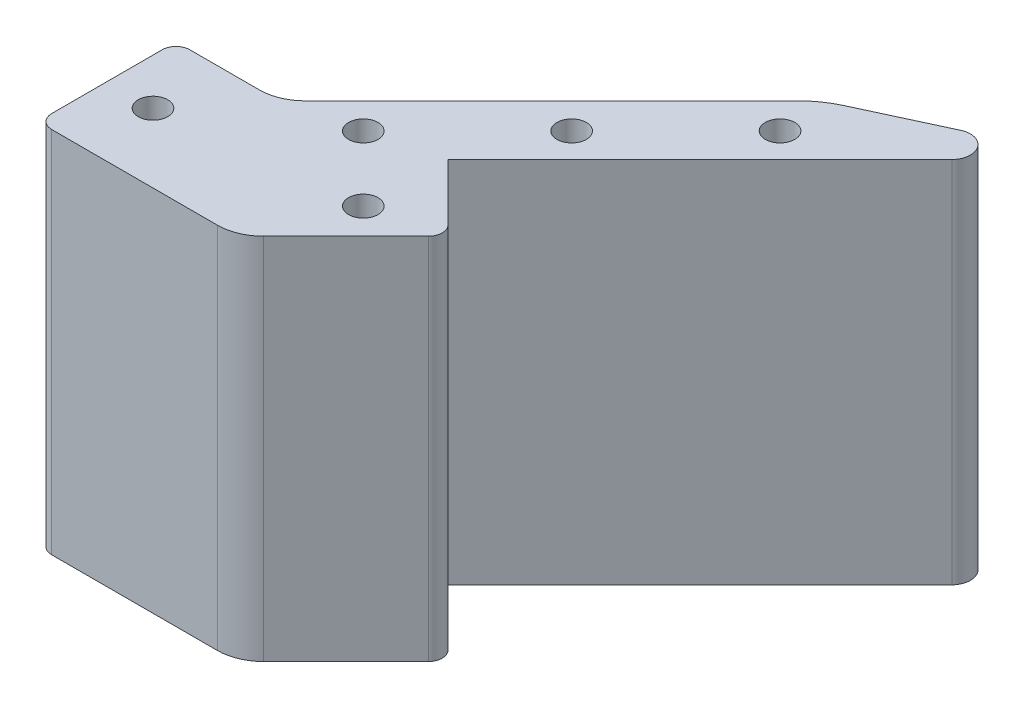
ISO-10303-21;
HEADER;
FILE_DESCRIPTION(('STEP AP214'),'2;1');
FILE_NAME('part.step','',(''),(''),'','','');
FILE_SCHEMA(('AUTOMOTIVE_DESIGN { 1 0 10303 214 1 1 1 1 }'));
ENDSEC;
DATA;
#1=APPLICATION_CONTEXT('core data for automotive mechanical design processes');
#2=APPLICATION_PROTOCOL_DEFINITION('international standard','automotive_design',2000,#1);
#3=PRODUCT_CONTEXT('',#1,'mechanical');
#4=PRODUCT('Part','Part','',(#3));
#5=PRODUCT_RELATED_PRODUCT_CATEGORY('part','',(#4));
#6=PRODUCT_DEFINITION_FORMATION('','',#4);
#7=PRODUCT_DEFINITION_CONTEXT('part definition',#1,'design');
#8=PRODUCT_DEFINITION('design','',#6,#7);
#9=PRODUCT_DEFINITION_SHAPE('','',#8);
#10=(LENGTH_UNIT() NAMED_UNIT(*) SI_UNIT(.MILLI.,.METRE.));
#11=(NAMED_UNIT(*) PLANE_ANGLE_UNIT() SI_UNIT($,.RADIAN.));
#12=(NAMED_UNIT(*) SI_UNIT($,.STERADIAN.) SOLID_ANGLE_UNIT());
#13=UNCERTAINTY_MEASURE_WITH_UNIT(LENGTH_MEASURE(1.E-05),#10,'distance_accuracy_value','');
#14=(GEOMETRIC_REPRESENTATION_CONTEXT(3) GLOBAL_UNCERTAINTY_ASSIGNED_CONTEXT((#13)) GLOBAL_UNIT_ASSIGNED_CONTEXT((#10,
#11,#12)) REPRESENTATION_CONTEXT('',''));
#15=CARTESIAN_POINT('',(0.,0.,0.));
#16=DIRECTION('',(0.,0.,1.));
#17=DIRECTION('',(1.,0.,0.));
#18=AXIS2_PLACEMENT_3D('',#15,#16,#17);
#19=CARTESIAN_POINT('',(-195.567787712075,40.,191.325147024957));
#20=DIRECTION('',(0.,1.,0.));
#21=DIRECTION('',(0.,0.,1.));
#22=AXIS2_PLACEMENT_3D('',#19,#20,#21);
#23=PLANE('',#22);
#24=CARTESIAN_POINT('',(-212.132034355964,40.,199.404112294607));
#25=DIRECTION('',(0.,1.,0.));
#26=DIRECTION('',(0.,0.,1.));
#27=AXIS2_PLACEMENT_3D('',#24,#25,#26);
#28=CIRCLE('',#27,1.59999999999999);
#29=CARTESIAN_POINT('',(-212.132034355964,40.,201.004112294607));
#30=VERTEX_POINT('',#29);
#31=EDGE_CURVE('E345',#30,#30,#28,.T.);
#32=ORIENTED_EDGE('',*,*,#31,.F.);
#33=EDGE_LOOP('',(#32));
#34=FACE_BOUND('',#33,.T.);
#35=CARTESIAN_POINT('',(-200.818325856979,40.,188.090403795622));
#36=DIRECTION('',(0.,1.,0.));
#37=DIRECTION('',(0.,0.,1.));
#38=AXIS2_PLACEMENT_3D('',#35,#36,#37);
#39=CIRCLE('',#38,1.59999999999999);
#40=CARTESIAN_POINT('',(-200.818325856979,40.,189.690403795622));
#41=VERTEX_POINT('',#40);
#42=EDGE_CURVE('E357',#41,#41,#39,.T.);
#43=ORIENTED_EDGE('',*,*,#42,.F.);
#44=EDGE_LOOP('',(#43));
#45=FACE_BOUND('',#44,.T.);
#46=DIRECTION('',(1.,0.,0.));
#47=VECTOR('',#46,1.);
#48=CARTESIAN_POINT('',(-242.,40.,227.5));
#49=LINE('',#48,#47);
#50=CARTESIAN_POINT('',(-240.5,40.,227.5));
#51=VERTEX_POINT('',#50);
#52=CARTESIAN_POINT('',(-222.499999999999,40.,227.5));
#53=VERTEX_POINT('',#52);
#54=EDGE_CURVE('E240',#51,#53,#49,.T.);
#55=ORIENTED_EDGE('',*,*,#54,.T.);
#56=CARTESIAN_POINT('',(-222.499999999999,40.,222.5));
#57=DIRECTION('',(0.,1.,0.));
#58=DIRECTION('',(0.,0.,1.));
#59=AXIS2_PLACEMENT_3D('',#56,#57,#58);
#60=CIRCLE('',#59,5.);
#61=CARTESIAN_POINT('',(-218.964466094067,40.,226.035533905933));
#62=VERTEX_POINT('',#61);
#63=EDGE_CURVE('E222',#53,#62,#60,.T.);
#64=ORIENTED_EDGE('',*,*,#63,.T.);
#65=DIRECTION('',(0.707106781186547,0.,-0.707106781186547));
#66=VECTOR('',#65,1.);
#67=CARTESIAN_POINT('',(-220.428932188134,40.,227.5));
#68=LINE('',#67,#66);
#69=CARTESIAN_POINT('',(-210.010714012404,40.,217.08178182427));
#70=VERTEX_POINT('',#69);
#71=EDGE_CURVE('E244',#62,#70,#68,.T.);
#72=ORIENTED_EDGE('',*,*,#71,.T.);
#73=CARTESIAN_POINT('',(-211.071374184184,40.,216.02112165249));
#74=DIRECTION('',(0.,1.,0.));
#75=DIRECTION('',(0.,0.,1.));
#76=AXIS2_PLACEMENT_3D('',#73,#74,#75);
#77=CIRCLE('',#76,1.5);
#78=CARTESIAN_POINT('',(-210.010714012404,40.,214.960461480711));
#79=VERTEX_POINT('',#78);
#80=EDGE_CURVE('E200',#70,#79,#77,.T.);
#81=ORIENTED_EDGE('',*,*,#80,.T.);
#82=DIRECTION('',(-0.707106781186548,0.,-0.707106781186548));
#83=VECTOR('',#82,1.);
#84=CARTESIAN_POINT('',(-208.950053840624,40.,216.02112165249));
#85=LINE('',#84,#83);
#86=CARTESIAN_POINT('',(-216.162543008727,40.,208.808632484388));
#87=VERTEX_POINT('',#86);
#88=EDGE_CURVE('E246',#79,#87,#85,.T.);
#89=ORIENTED_EDGE('',*,*,#88,.T.);
#90=DIRECTION('',(0.707106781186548,0.,-0.707106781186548));
#91=VECTOR('',#90,1.);
#92=CARTESIAN_POINT('',(-216.162543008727,40.,208.808632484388));
#93=LINE('',#92,#91);
#94=CARTESIAN_POINT('',(-188.79688181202,40.,181.44297128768));
#95=VERTEX_POINT('',#94);
#96=EDGE_CURVE('E248',#87,#95,#93,.T.);
#97=ORIENTED_EDGE('',*,*,#96,.T.);
#98=CARTESIAN_POINT('',(-190.211095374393,40.,180.028757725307));
#99=DIRECTION('',(0.,1.,0.));
#100=DIRECTION('',(0.,0.,1.));
#101=AXIS2_PLACEMENT_3D('',#98,#99,#100);
#102=CIRCLE('',#101,2.);
#103=CARTESIAN_POINT('',(-191.051460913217,40.,178.213878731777));
#104=VERTEX_POINT('',#103);
#105=EDGE_CURVE('E250',#95,#104,#102,.T.);
#106=ORIENTED_EDGE('',*,*,#105,.T.);
#107=DIRECTION('',(-0.907439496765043,0.,0.420182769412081));
#108=VECTOR('',#107,1.);
#109=CARTESIAN_POINT('',(-191.051460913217,40.,178.213878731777));
#110=LINE('',#109,#108);
#111=CARTESIAN_POINT('',(-199.769615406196,40.,182.250752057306));
#112=VERTEX_POINT('',#111);
#113=EDGE_CURVE('E166',#104,#112,#110,.T.);
#114=ORIENTED_EDGE('',*,*,#113,.T.);
#115=CARTESIAN_POINT('',(-195.567787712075,40.,191.325147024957));
#116=DIRECTION('',(0.,1.,0.));
#117=DIRECTION('',(0.,0.,1.));
#118=AXIS2_PLACEMENT_3D('',#115,#116,#117);
#119=CIRCLE('',#118,9.99999999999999);
#120=CARTESIAN_POINT('',(-202.638855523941,40.,184.254079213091));
#121=VERTEX_POINT('',#120);
#122=EDGE_CURVE('E161',#112,#121,#119,.T.);
#123=ORIENTED_EDGE('',*,*,#122,.T.);
#124=DIRECTION('',(-0.707106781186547,0.,0.707106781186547));
#125=VECTOR('',#124,1.);
#126=CARTESIAN_POINT('',(-202.638855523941,40.,184.254079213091));
#127=LINE('',#126,#125);
#128=CARTESIAN_POINT('',(-229.420310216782,40.,211.035533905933));
#129=VERTEX_POINT('',#128);
#130=EDGE_CURVE('E149',#121,#129,#127,.T.);
#131=ORIENTED_EDGE('',*,*,#130,.T.);
#132=CARTESIAN_POINT('',(-232.955844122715,40.,207.5));
#133=DIRECTION('',(0.,1.,0.));
#134=DIRECTION('',(0.,0.,1.));
#135=AXIS2_PLACEMENT_3D('',#132,#133,#134);
#136=CIRCLE('',#135,5.);
#137=CARTESIAN_POINT('',(-232.955844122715,40.,212.5));
#138=VERTEX_POINT('',#137);
#139=EDGE_CURVE('E11',#129,#138,#136,.F.);
#140=ORIENTED_EDGE('',*,*,#139,.T.);
#141=DIRECTION('',(-1.,0.,0.));
#142=VECTOR('',#141,1.);
#143=CARTESIAN_POINT('',(-230.88477631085,40.,212.5));
#144=LINE('',#143,#142);
#145=CARTESIAN_POINT('',(-240.5,40.,212.5));
#146=VERTEX_POINT('',#145);
#147=EDGE_CURVE('E160',#138,#146,#144,.T.);
#148=ORIENTED_EDGE('',*,*,#147,.T.);
#149=CARTESIAN_POINT('',(-240.5,40.,214.));
#150=DIRECTION('',(0.,1.,0.));
#151=DIRECTION('',(0.,0.,1.));
#152=AXIS2_PLACEMENT_3D('',#149,#150,#151);
#153=CIRCLE('',#152,1.5);
#154=CARTESIAN_POINT('',(-242.,40.,214.));
#155=VERTEX_POINT('',#154);
#156=EDGE_CURVE('E198',#146,#155,#153,.T.);
#157=ORIENTED_EDGE('',*,*,#156,.T.);
#158=DIRECTION('',(0.,0.,1.));
#159=VECTOR('',#158,1.);
#160=CARTESIAN_POINT('',(-242.,40.,212.5));
#161=LINE('',#160,#159);
#162=CARTESIAN_POINT('',(-242.,40.,226.));
#163=VERTEX_POINT('',#162);
#164=EDGE_CURVE('E237',#155,#163,#161,.T.);
#165=ORIENTED_EDGE('',*,*,#164,.T.);
#166=CARTESIAN_POINT('',(-240.5,40.,226.));
#167=DIRECTION('',(0.,1.,0.));
#168=DIRECTION('',(0.,0.,1.));
#169=AXIS2_PLACEMENT_3D('',#166,#167,#168);
#170=CIRCLE('',#169,1.5);
#171=EDGE_CURVE('E196',#163,#51,#170,.T.);
#172=ORIENTED_EDGE('',*,*,#171,.T.);
#173=EDGE_LOOP('',(#55,#64,#72,#81,#89,#97,#106,#114,#123,#131,#140,#148,#157,#165,#172));
#174=FACE_BOUND('',#173,.T.);
#175=CARTESIAN_POINT('',(-237.,40.,220.));
#176=DIRECTION('',(0.,1.,0.));
#177=DIRECTION('',(0.,0.,1.));
#178=AXIS2_PLACEMENT_3D('',#175,#176,#177);
#179=CIRCLE('',#178,1.59999999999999);
#180=CARTESIAN_POINT('',(-237.,40.,221.6));
#181=VERTEX_POINT('',#180);
#182=EDGE_CURVE('E254',#181,#181,#179,.T.);
#183=ORIENTED_EDGE('',*,*,#182,.F.);
#184=EDGE_LOOP('',(#183));
#185=FACE_BOUND('',#184,.T.);
#186=CARTESIAN_POINT('',(-216.374675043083,40.,217.788888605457));
#187=DIRECTION('',(0.,1.,0.));
#188=DIRECTION('',(0.,0.,1.));
#189=AXIS2_PLACEMENT_3D('',#186,#187,#188);
#190=CIRCLE('',#189,1.59999999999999);
#191=CARTESIAN_POINT('',(-216.374675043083,40.,219.388888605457));
#192=VERTEX_POINT('',#191);
#193=EDGE_CURVE('E351',#192,#192,#190,.T.);
#194=ORIENTED_EDGE('',*,*,#193,.F.);
#195=EDGE_LOOP('',(#194));
#196=FACE_BOUND('',#195,.T.);
#197=CARTESIAN_POINT('',(-223.445742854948,40.,210.717820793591));
#198=DIRECTION('',(0.,1.,0.));
#199=DIRECTION('',(0.,0.,1.));
#200=AXIS2_PLACEMENT_3D('',#197,#198,#199);
#201=CIRCLE('',#200,1.59999999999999);
#202=CARTESIAN_POINT('',(-223.445742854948,40.,212.317820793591));
#203=VERTEX_POINT('',#202);
#204=EDGE_CURVE('E336',#203,#203,#201,.T.);
#205=ORIENTED_EDGE('',*,*,#204,.F.);
#206=EDGE_LOOP('',(#205));
#207=FACE_BOUND('',#206,.T.);
#208=ADVANCED_FACE('F41',(#34,#45,#174,#185,#196,#207),#23,.T.);
#209=CARTESIAN_POINT('',(-195.567787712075,0.,191.325147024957));
#210=DIRECTION('',(0.,1.,0.));
#211=DIRECTION('',(0.,0.,1.));
#212=AXIS2_PLACEMENT_3D('',#209,#210,#211);
#213=PLANE('',#212);
#214=DIRECTION('',(0.707106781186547,0.,-0.707106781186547));
#215=VECTOR('',#214,1.);
#216=CARTESIAN_POINT('',(-220.428932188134,0.,227.5));
#217=LINE('',#216,#215);
#218=CARTESIAN_POINT('',(-218.964466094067,0.,226.035533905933));
#219=VERTEX_POINT('',#218);
#220=CARTESIAN_POINT('',(-210.010714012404,0.,217.08178182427));
#221=VERTEX_POINT('',#220);
#222=EDGE_CURVE('E262',#219,#221,#217,.T.);
#223=ORIENTED_EDGE('',*,*,#222,.F.);
#224=CARTESIAN_POINT('',(-222.499999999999,0.,222.5));
#225=DIRECTION('',(0.,1.,0.));
#226=DIRECTION('',(0.,0.,1.));
#227=AXIS2_PLACEMENT_3D('',#224,#225,#226);
#228=CIRCLE('',#227,5.);
#229=CARTESIAN_POINT('',(-222.499999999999,0.,227.5));
#230=VERTEX_POINT('',#229);
#231=EDGE_CURVE('E64',#219,#230,#228,.F.);
#232=ORIENTED_EDGE('',*,*,#231,.T.);
#233=DIRECTION('',(1.,0.,0.));
#234=VECTOR('',#233,1.);
#235=CARTESIAN_POINT('',(-242.,0.,227.5));
#236=LINE('',#235,#234);
#237=CARTESIAN_POINT('',(-240.5,0.,227.5));
#238=VERTEX_POINT('',#237);
#239=EDGE_CURVE('E260',#238,#230,#236,.T.);
#240=ORIENTED_EDGE('',*,*,#239,.F.);
#241=CARTESIAN_POINT('',(-240.5,0.,226.));
#242=DIRECTION('',(0.,1.,0.));
#243=DIRECTION('',(0.,0.,1.));
#244=AXIS2_PLACEMENT_3D('',#241,#242,#243);
#245=CIRCLE('',#244,1.5);
#246=CARTESIAN_POINT('',(-242.,0.,226.));
#247=VERTEX_POINT('',#246);
#248=EDGE_CURVE('E179',#238,#247,#245,.F.);
#249=ORIENTED_EDGE('',*,*,#248,.T.);
#250=DIRECTION('',(0.,0.,1.));
#251=VECTOR('',#250,1.);
#252=CARTESIAN_POINT('',(-242.,0.,212.5));
#253=LINE('',#252,#251);
#254=CARTESIAN_POINT('',(-242.,0.,214.));
#255=VERTEX_POINT('',#254);
#256=EDGE_CURVE('E257',#255,#247,#253,.T.);
#257=ORIENTED_EDGE('',*,*,#256,.F.);
#258=CARTESIAN_POINT('',(-240.5,0.,214.));
#259=DIRECTION('',(0.,1.,0.));
#260=DIRECTION('',(0.,0.,1.));
#261=AXIS2_PLACEMENT_3D('',#258,#259,#260);
#262=CIRCLE('',#261,1.5);
#263=CARTESIAN_POINT('',(-240.5,0.,212.5));
#264=VERTEX_POINT('',#263);
#265=EDGE_CURVE('E187',#255,#264,#262,.F.);
#266=ORIENTED_EDGE('',*,*,#265,.T.);
#267=DIRECTION('',(-1.,0.,0.));
#268=VECTOR('',#267,1.);
#269=CARTESIAN_POINT('',(-230.88477631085,0.,212.5));
#270=LINE('',#269,#268);
#271=CARTESIAN_POINT('',(-232.955844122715,0.,212.5));
#272=VERTEX_POINT('',#271);
#273=EDGE_CURVE('E227',#272,#264,#270,.T.);
#274=ORIENTED_EDGE('',*,*,#273,.F.);
#275=CARTESIAN_POINT('',(-232.955844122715,0.,207.5));
#276=DIRECTION('',(0.,1.,0.));
#277=DIRECTION('',(0.,0.,1.));
#278=AXIS2_PLACEMENT_3D('',#275,#276,#277);
#279=CIRCLE('',#278,5.);
#280=CARTESIAN_POINT('',(-229.420310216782,0.,211.035533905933));
#281=VERTEX_POINT('',#280);
#282=EDGE_CURVE('E49',#272,#281,#279,.T.);
#283=ORIENTED_EDGE('',*,*,#282,.T.);
#284=DIRECTION('',(-0.707106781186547,0.,0.707106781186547));
#285=VECTOR('',#284,1.);
#286=CARTESIAN_POINT('',(-202.638855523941,0.,184.254079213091));
#287=LINE('',#286,#285);
#288=CARTESIAN_POINT('',(-202.638855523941,0.,184.254079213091));
#289=VERTEX_POINT('',#288);
#290=EDGE_CURVE('E226',#289,#281,#287,.T.);
#291=ORIENTED_EDGE('',*,*,#290,.F.);
#292=CARTESIAN_POINT('',(-195.567787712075,0.,191.325147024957));
#293=DIRECTION('',(0.,1.,0.));
#294=DIRECTION('',(0.,0.,1.));
#295=AXIS2_PLACEMENT_3D('',#292,#293,#294);
#296=CIRCLE('',#295,9.99999999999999);
#297=CARTESIAN_POINT('',(-199.769615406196,0.,182.250752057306));
#298=VERTEX_POINT('',#297);
#299=EDGE_CURVE('E174',#298,#289,#296,.T.);
#300=ORIENTED_EDGE('',*,*,#299,.F.);
#301=DIRECTION('',(-0.907439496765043,0.,0.420182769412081));
#302=VECTOR('',#301,1.);
#303=CARTESIAN_POINT('',(-191.051460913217,0.,178.213878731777));
#304=LINE('',#303,#302);
#305=CARTESIAN_POINT('',(-191.051460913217,0.,178.213878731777));
#306=VERTEX_POINT('',#305);
#307=EDGE_CURVE('E170',#306,#298,#304,.T.);
#308=ORIENTED_EDGE('',*,*,#307,.F.);
#309=CARTESIAN_POINT('',(-190.211095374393,0.,180.028757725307));
#310=DIRECTION('',(0.,1.,0.));
#311=DIRECTION('',(0.,0.,1.));
#312=AXIS2_PLACEMENT_3D('',#309,#310,#311);
#313=CIRCLE('',#312,2.);
#314=CARTESIAN_POINT('',(-188.79688181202,0.,181.44297128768));
#315=VERTEX_POINT('',#314);
#316=EDGE_CURVE('E268',#315,#306,#313,.T.);
#317=ORIENTED_EDGE('',*,*,#316,.F.);
#318=DIRECTION('',(0.707106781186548,0.,-0.707106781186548));
#319=VECTOR('',#318,1.);
#320=CARTESIAN_POINT('',(-216.162543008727,0.,208.808632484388));
#321=LINE('',#320,#319);
#322=CARTESIAN_POINT('',(-216.162543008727,0.,208.808632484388));
#323=VERTEX_POINT('',#322);
#324=EDGE_CURVE('E266',#323,#315,#321,.T.);
#325=ORIENTED_EDGE('',*,*,#324,.F.);
#326=DIRECTION('',(-0.707106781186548,0.,-0.707106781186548));
#327=VECTOR('',#326,1.);
#328=CARTESIAN_POINT('',(-208.950053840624,0.,216.02112165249));
#329=LINE('',#328,#327);
#330=CARTESIAN_POINT('',(-210.010714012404,0.,214.960461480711));
#331=VERTEX_POINT('',#330);
#332=EDGE_CURVE('E264',#331,#323,#329,.T.);
#333=ORIENTED_EDGE('',*,*,#332,.F.);
#334=CARTESIAN_POINT('',(-211.071374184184,0.,216.02112165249));
#335=DIRECTION('',(0.,1.,0.));
#336=DIRECTION('',(0.,0.,1.));
#337=AXIS2_PLACEMENT_3D('',#334,#335,#336);
#338=CIRCLE('',#337,1.5);
#339=EDGE_CURVE('E190',#331,#221,#338,.F.);
#340=ORIENTED_EDGE('',*,*,#339,.T.);
#341=EDGE_LOOP('',(#223,#232,#240,#249,#257,#266,#274,#283,#291,#300,#308,#317,#325,#333,#340));
#342=FACE_BOUND('',#341,.T.);
#343=CARTESIAN_POINT('',(-237.,0.,220.));
#344=DIRECTION('',(0.,1.,0.));
#345=DIRECTION('',(0.,0.,1.));
#346=AXIS2_PLACEMENT_3D('',#343,#344,#345);
#347=CIRCLE('',#346,1.59999999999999);
#348=CARTESIAN_POINT('',(-237.,0.,221.6));
#349=VERTEX_POINT('',#348);
#350=EDGE_CURVE('E360',#349,#349,#347,.T.);
#351=ORIENTED_EDGE('',*,*,#350,.T.);
#352=EDGE_LOOP('',(#351));
#353=FACE_BOUND('',#352,.T.);
#354=CARTESIAN_POINT('',(-200.818325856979,0.,188.090403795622));
#355=DIRECTION('',(0.,1.,0.));
#356=DIRECTION('',(0.,0.,1.));
#357=AXIS2_PLACEMENT_3D('',#354,#355,#356);
#358=CIRCLE('',#357,1.59999999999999);
#359=CARTESIAN_POINT('',(-200.818325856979,0.,189.690403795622));
#360=VERTEX_POINT('',#359);
#361=EDGE_CURVE('E354',#360,#360,#358,.T.);
#362=ORIENTED_EDGE('',*,*,#361,.T.);
#363=EDGE_LOOP('',(#362));
#364=FACE_BOUND('',#363,.T.);
#365=CARTESIAN_POINT('',(-216.374675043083,0.,217.788888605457));
#366=DIRECTION('',(0.,1.,0.));
#367=DIRECTION('',(0.,0.,1.));
#368=AXIS2_PLACEMENT_3D('',#365,#366,#367);
#369=CIRCLE('',#368,1.59999999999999);
#370=CARTESIAN_POINT('',(-216.374675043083,0.,219.388888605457));
#371=VERTEX_POINT('',#370);
#372=EDGE_CURVE('E348',#371,#371,#369,.T.);
#373=ORIENTED_EDGE('',*,*,#372,.T.);
#374=EDGE_LOOP('',(#373));
#375=FACE_BOUND('',#374,.T.);
#376=CARTESIAN_POINT('',(-212.132034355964,0.,199.404112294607));
#377=DIRECTION('',(0.,1.,0.));
#378=DIRECTION('',(0.,0.,1.));
#379=AXIS2_PLACEMENT_3D('',#376,#377,#378);
#380=CIRCLE('',#379,1.59999999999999);
#381=CARTESIAN_POINT('',(-212.132034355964,0.,201.004112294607));
#382=VERTEX_POINT('',#381);
#383=EDGE_CURVE('E342',#382,#382,#380,.T.);
#384=ORIENTED_EDGE('',*,*,#383,.T.);
#385=EDGE_LOOP('',(#384));
#386=FACE_BOUND('',#385,.T.);
#387=CARTESIAN_POINT('',(-223.445742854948,0.,210.717820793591));
#388=DIRECTION('',(0.,1.,0.));
#389=DIRECTION('',(0.,0.,1.));
#390=AXIS2_PLACEMENT_3D('',#387,#388,#389);
#391=CIRCLE('',#390,1.59999999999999);
#392=CARTESIAN_POINT('',(-223.445742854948,0.,212.317820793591));
#393=VERTEX_POINT('',#392);
#394=EDGE_CURVE('E339',#393,#393,#391,.T.);
#395=ORIENTED_EDGE('',*,*,#394,.T.);
#396=EDGE_LOOP('',(#395));
#397=FACE_BOUND('',#396,.T.);
#398=ADVANCED_FACE('F224',(#342,#353,#364,#375,#386,#397),#213,.F.);
#399=CARTESIAN_POINT('',(-195.567787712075,40.,191.325147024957));
#400=DIRECTION('',(0.,-1.,0.));
#401=DIRECTION('',(0.,0.,-1.));
#402=AXIS2_PLACEMENT_3D('',#399,#400,#401);
#403=CYLINDRICAL_SURFACE('',#402,9.99999999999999);
#404=ORIENTED_EDGE('',*,*,#299,.T.);
#405=DIRECTION('',(0.,-1.,0.));
#406=VECTOR('',#405,1.);
#407=CARTESIAN_POINT('',(-202.638855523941,40.,184.254079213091));
#408=LINE('',#407,#406);
#409=EDGE_CURVE('E154',#121,#289,#408,.T.);
#410=ORIENTED_EDGE('',*,*,#409,.F.);
#411=ORIENTED_EDGE('',*,*,#122,.F.);
#412=DIRECTION('',(0.,-1.,0.));
#413=VECTOR('',#412,1.);
#414=CARTESIAN_POINT('',(-199.769615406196,40.,182.250752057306));
#415=LINE('',#414,#413);
#416=EDGE_CURVE('E253',#112,#298,#415,.T.);
#417=ORIENTED_EDGE('',*,*,#416,.T.);
#418=EDGE_LOOP('',(#404,#410,#411,#417));
#419=FACE_BOUND('',#418,.T.);
#420=ADVANCED_FACE('F172',(#419),#403,.T.);
#421=CARTESIAN_POINT('',(-202.638855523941,40.,184.254079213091));
#422=DIRECTION('',(0.707106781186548,0.,0.707106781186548));
#423=DIRECTION('',(0.707106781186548,0.,-0.707106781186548));
#424=AXIS2_PLACEMENT_3D('',#421,#422,#423);
#425=PLANE('',#424);
#426=ORIENTED_EDGE('',*,*,#290,.T.);
#427=DIRECTION('',(0.,-1.,0.));
#428=VECTOR('',#427,1.);
#429=CARTESIAN_POINT('',(-229.420310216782,40.,211.035533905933));
#430=LINE('',#429,#428);
#431=EDGE_CURVE('E157',#281,#129,#430,.F.);
#432=ORIENTED_EDGE('',*,*,#431,.T.);
#433=ORIENTED_EDGE('',*,*,#130,.F.);
#434=ORIENTED_EDGE('',*,*,#409,.T.);
#435=EDGE_LOOP('',(#426,#432,#433,#434));
#436=FACE_BOUND('',#435,.T.);
#437=ADVANCED_FACE('F152',(#436),#425,.F.);
#438=CARTESIAN_POINT('',(-230.88477631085,40.,212.5));
#439=DIRECTION('',(0.,0.,1.));
#440=DIRECTION('',(1.,0.,0.));
#441=AXIS2_PLACEMENT_3D('',#438,#439,#440);
#442=PLANE('',#441);
#443=ORIENTED_EDGE('',*,*,#147,.F.);
#444=DIRECTION('',(0.,-1.,0.));
#445=VECTOR('',#444,1.);
#446=CARTESIAN_POINT('',(-232.955844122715,0.,212.5));
#447=LINE('',#446,#445);
#448=EDGE_CURVE('E213',#138,#272,#447,.T.);
#449=ORIENTED_EDGE('',*,*,#448,.T.);
#450=ORIENTED_EDGE('',*,*,#273,.T.);
#451=DIRECTION('',(0.,-1.,0.));
#452=VECTOR('',#451,1.);
#453=CARTESIAN_POINT('',(-240.5,40.,212.5));
#454=LINE('',#453,#452);
#455=EDGE_CURVE('E207',#264,#146,#454,.F.);
#456=ORIENTED_EDGE('',*,*,#455,.T.);
#457=EDGE_LOOP('',(#443,#449,#450,#456));
#458=FACE_BOUND('',#457,.T.);
#459=ADVANCED_FACE('F234',(#458),#442,.F.);
#460=CARTESIAN_POINT('',(-242.,40.,212.5));
#461=DIRECTION('',(1.,0.,0.));
#462=DIRECTION('',(0.,0.,-1.));
#463=AXIS2_PLACEMENT_3D('',#460,#461,#462);
#464=PLANE('',#463);
#465=ORIENTED_EDGE('',*,*,#164,.F.);
#466=DIRECTION('',(0.,-1.,0.));
#467=VECTOR('',#466,1.);
#468=CARTESIAN_POINT('',(-242.,40.,214.));
#469=LINE('',#468,#467);
#470=EDGE_CURVE('E204',#155,#255,#469,.T.);
#471=ORIENTED_EDGE('',*,*,#470,.T.);
#472=ORIENTED_EDGE('',*,*,#256,.T.);
#473=DIRECTION('',(0.,-1.,0.));
#474=VECTOR('',#473,1.);
#475=CARTESIAN_POINT('',(-242.,40.,226.));
#476=LINE('',#475,#474);
#477=EDGE_CURVE('E202',#247,#163,#476,.F.);
#478=ORIENTED_EDGE('',*,*,#477,.T.);
#479=EDGE_LOOP('',(#465,#471,#472,#478));
#480=FACE_BOUND('',#479,.T.);
#481=ADVANCED_FACE('F424',(#480),#464,.F.);
#482=CARTESIAN_POINT('',(-242.,40.,227.5));
#483=DIRECTION('',(0.,0.,-1.));
#484=DIRECTION('',(-1.,0.,0.));
#485=AXIS2_PLACEMENT_3D('',#482,#483,#484);
#486=PLANE('',#485);
#487=ORIENTED_EDGE('',*,*,#239,.T.);
#488=DIRECTION('',(0.,-1.,0.));
#489=VECTOR('',#488,1.);
#490=CARTESIAN_POINT('',(-222.499999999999,40.,227.5));
#491=LINE('',#490,#489);
#492=EDGE_CURVE('E56',#230,#53,#491,.F.);
#493=ORIENTED_EDGE('',*,*,#492,.T.);
#494=ORIENTED_EDGE('',*,*,#54,.F.);
#495=DIRECTION('',(0.,-1.,0.));
#496=VECTOR('',#495,1.);
#497=CARTESIAN_POINT('',(-240.5,40.,227.5));
#498=LINE('',#497,#496);
#499=EDGE_CURVE('E210',#51,#238,#498,.T.);
#500=ORIENTED_EDGE('',*,*,#499,.T.);
#501=EDGE_LOOP('',(#487,#493,#494,#500));
#502=FACE_BOUND('',#501,.T.);
#503=ADVANCED_FACE('F421',(#502),#486,.F.);
#504=CARTESIAN_POINT('',(-220.428932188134,40.,227.5));
#505=DIRECTION('',(-0.707106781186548,0.,-0.707106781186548));
#506=DIRECTION('',(-0.707106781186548,0.,0.707106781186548));
#507=AXIS2_PLACEMENT_3D('',#504,#505,#506);
#508=PLANE('',#507);
#509=ORIENTED_EDGE('',*,*,#71,.F.);
#510=DIRECTION('',(0.,-1.,0.));
#511=VECTOR('',#510,1.);
#512=CARTESIAN_POINT('',(-218.964466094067,40.,226.035533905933));
#513=LINE('',#512,#511);
#514=EDGE_CURVE('E217',#62,#219,#513,.T.);
#515=ORIENTED_EDGE('',*,*,#514,.T.);
#516=ORIENTED_EDGE('',*,*,#222,.T.);
#517=DIRECTION('',(0.,-1.,0.));
#518=VECTOR('',#517,1.);
#519=CARTESIAN_POINT('',(-210.010714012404,40.,217.08178182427));
#520=LINE('',#519,#518);
#521=EDGE_CURVE('E193',#221,#70,#520,.F.);
#522=ORIENTED_EDGE('',*,*,#521,.T.);
#523=EDGE_LOOP('',(#509,#515,#516,#522));
#524=FACE_BOUND('',#523,.T.);
#525=ADVANCED_FACE('F406',(#524),#508,.F.);
#526=CARTESIAN_POINT('',(-208.950053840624,40.,216.02112165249));
#527=DIRECTION('',(-0.707106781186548,0.,0.707106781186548));
#528=DIRECTION('',(0.707106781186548,0.,0.707106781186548));
#529=AXIS2_PLACEMENT_3D('',#526,#527,#528);
#530=PLANE('',#529);
#531=ORIENTED_EDGE('',*,*,#88,.F.);
#532=DIRECTION('',(0.,-1.,0.));
#533=VECTOR('',#532,1.);
#534=CARTESIAN_POINT('',(-210.010714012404,40.,214.960461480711));
#535=LINE('',#534,#533);
#536=EDGE_CURVE('E175',#79,#331,#535,.T.);
#537=ORIENTED_EDGE('',*,*,#536,.T.);
#538=ORIENTED_EDGE('',*,*,#332,.T.);
#539=DIRECTION('',(0.,-1.,0.));
#540=VECTOR('',#539,1.);
#541=CARTESIAN_POINT('',(-216.162543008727,40.,208.808632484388));
#542=LINE('',#541,#540);
#543=EDGE_CURVE('E176',#87,#323,#542,.T.);
#544=ORIENTED_EDGE('',*,*,#543,.F.);
#545=EDGE_LOOP('',(#531,#537,#538,#544));
#546=FACE_BOUND('',#545,.T.);
#547=ADVANCED_FACE('F412',(#546),#530,.F.);
#548=CARTESIAN_POINT('',(-216.162543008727,40.,208.808632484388));
#549=DIRECTION('',(-0.707106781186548,0.,-0.707106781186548));
#550=DIRECTION('',(-0.707106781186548,0.,0.707106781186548));
#551=AXIS2_PLACEMENT_3D('',#548,#549,#550);
#552=PLANE('',#551);
#553=ORIENTED_EDGE('',*,*,#324,.T.);
#554=DIRECTION('',(0.,-1.,0.));
#555=VECTOR('',#554,1.);
#556=CARTESIAN_POINT('',(-188.79688181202,40.,181.44297128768));
#557=LINE('',#556,#555);
#558=EDGE_CURVE('E182',#95,#315,#557,.T.);
#559=ORIENTED_EDGE('',*,*,#558,.F.);
#560=ORIENTED_EDGE('',*,*,#96,.F.);
#561=ORIENTED_EDGE('',*,*,#543,.T.);
#562=EDGE_LOOP('',(#553,#559,#560,#561));
#563=FACE_BOUND('',#562,.T.);
#564=ADVANCED_FACE('F298',(#563),#552,.F.);
#565=CARTESIAN_POINT('',(-190.211095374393,40.,180.028757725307));
#566=DIRECTION('',(0.,-1.,0.));
#567=DIRECTION('',(0.,0.,-1.));
#568=AXIS2_PLACEMENT_3D('',#565,#566,#567);
#569=CYLINDRICAL_SURFACE('',#568,2.);
#570=ORIENTED_EDGE('',*,*,#316,.T.);
#571=DIRECTION('',(0.,-1.,0.));
#572=VECTOR('',#571,1.);
#573=CARTESIAN_POINT('',(-191.051460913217,40.,178.213878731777));
#574=LINE('',#573,#572);
#575=EDGE_CURVE('E272',#104,#306,#574,.T.);
#576=ORIENTED_EDGE('',*,*,#575,.F.);
#577=ORIENTED_EDGE('',*,*,#105,.F.);
#578=ORIENTED_EDGE('',*,*,#558,.T.);
#579=EDGE_LOOP('',(#570,#576,#577,#578));
#580=FACE_BOUND('',#579,.T.);
#581=ADVANCED_FACE('F279',(#580),#569,.T.);
#582=CARTESIAN_POINT('',(-191.051460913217,40.,178.213878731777));
#583=DIRECTION('',(0.420182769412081,0.,0.907439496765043));
#584=DIRECTION('',(0.907439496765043,0.,-0.420182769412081));
#585=AXIS2_PLACEMENT_3D('',#582,#583,#584);
#586=PLANE('',#585);
#587=ORIENTED_EDGE('',*,*,#307,.T.);
#588=ORIENTED_EDGE('',*,*,#416,.F.);
#589=ORIENTED_EDGE('',*,*,#113,.F.);
#590=ORIENTED_EDGE('',*,*,#575,.T.);
#591=EDGE_LOOP('',(#587,#588,#589,#590));
#592=FACE_BOUND('',#591,.T.);
#593=ADVANCED_FACE('F287',(#592),#586,.F.);
#594=CARTESIAN_POINT('',(-237.,40.,220.));
#595=DIRECTION('',(0.,-1.,0.));
#596=DIRECTION('',(0.,0.,-1.));
#597=AXIS2_PLACEMENT_3D('',#594,#595,#596);
#598=CYLINDRICAL_SURFACE('',#597,1.59999999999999);
#599=ORIENTED_EDGE('',*,*,#182,.T.);
#600=EDGE_LOOP('',(#599));
#601=FACE_BOUND('',#600,.T.);
#602=ORIENTED_EDGE('',*,*,#350,.F.);
#603=EDGE_LOOP('',(#602));
#604=FACE_BOUND('',#603,.T.);
#605=ADVANCED_FACE('F289',(#601,#604),#598,.F.);
#606=CARTESIAN_POINT('',(-200.818325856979,40.,188.090403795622));
#607=DIRECTION('',(0.,-1.,0.));
#608=DIRECTION('',(0.,0.,-1.));
#609=AXIS2_PLACEMENT_3D('',#606,#607,#608);
#610=CYLINDRICAL_SURFACE('',#609,1.59999999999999);
#611=ORIENTED_EDGE('',*,*,#42,.T.);
#612=EDGE_LOOP('',(#611));
#613=FACE_BOUND('',#612,.T.);
#614=ORIENTED_EDGE('',*,*,#361,.F.);
#615=EDGE_LOOP('',(#614));
#616=FACE_BOUND('',#615,.T.);
#617=ADVANCED_FACE('F295',(#613,#616),#610,.F.);
#618=CARTESIAN_POINT('',(-216.374675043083,40.,217.788888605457));
#619=DIRECTION('',(0.,-1.,0.));
#620=DIRECTION('',(0.,0.,-1.));
#621=AXIS2_PLACEMENT_3D('',#618,#619,#620);
#622=CYLINDRICAL_SURFACE('',#621,1.59999999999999);
#623=ORIENTED_EDGE('',*,*,#193,.T.);
#624=EDGE_LOOP('',(#623));
#625=FACE_BOUND('',#624,.T.);
#626=ORIENTED_EDGE('',*,*,#372,.F.);
#627=EDGE_LOOP('',(#626));
#628=FACE_BOUND('',#627,.T.);
#629=ADVANCED_FACE('F313',(#625,#628),#622,.F.);
#630=CARTESIAN_POINT('',(-212.132034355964,40.,199.404112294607));
#631=DIRECTION('',(0.,-1.,0.));
#632=DIRECTION('',(0.,0.,-1.));
#633=AXIS2_PLACEMENT_3D('',#630,#631,#632);
#634=CYLINDRICAL_SURFACE('',#633,1.59999999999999);
#635=ORIENTED_EDGE('',*,*,#31,.T.);
#636=EDGE_LOOP('',(#635));
#637=FACE_BOUND('',#636,.T.);
#638=ORIENTED_EDGE('',*,*,#383,.F.);
#639=EDGE_LOOP('',(#638));
#640=FACE_BOUND('',#639,.T.);
#641=ADVANCED_FACE('F317',(#637,#640),#634,.F.);
#642=CARTESIAN_POINT('',(-223.445742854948,40.,210.717820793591));
#643=DIRECTION('',(0.,-1.,0.));
#644=DIRECTION('',(0.,0.,-1.));
#645=AXIS2_PLACEMENT_3D('',#642,#643,#644);
#646=CYLINDRICAL_SURFACE('',#645,1.59999999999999);
#647=ORIENTED_EDGE('',*,*,#204,.T.);
#648=EDGE_LOOP('',(#647));
#649=FACE_BOUND('',#648,.T.);
#650=ORIENTED_EDGE('',*,*,#394,.F.);
#651=EDGE_LOOP('',(#650));
#652=FACE_BOUND('',#651,.T.);
#653=ADVANCED_FACE('F321',(#649,#652),#646,.F.);
#654=CARTESIAN_POINT('',(-211.071374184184,40.,216.02112165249));
#655=DIRECTION('',(0.,-1.,0.));
#656=DIRECTION('',(0.,0.,-1.));
#657=AXIS2_PLACEMENT_3D('',#654,#655,#656);
#658=CYLINDRICAL_SURFACE('',#657,1.5);
#659=ORIENTED_EDGE('',*,*,#80,.F.);
#660=ORIENTED_EDGE('',*,*,#521,.F.);
#661=ORIENTED_EDGE('',*,*,#339,.F.);
#662=ORIENTED_EDGE('',*,*,#536,.F.);
#663=EDGE_LOOP('',(#659,#660,#661,#662));
#664=FACE_BOUND('',#663,.T.);
#665=ADVANCED_FACE('F324',(#664),#658,.T.);
#666=CARTESIAN_POINT('',(-240.5,40.,214.));
#667=DIRECTION('',(0.,-1.,0.));
#668=DIRECTION('',(0.,0.,-1.));
#669=AXIS2_PLACEMENT_3D('',#666,#667,#668);
#670=CYLINDRICAL_SURFACE('',#669,1.5);
#671=ORIENTED_EDGE('',*,*,#156,.F.);
#672=ORIENTED_EDGE('',*,*,#455,.F.);
#673=ORIENTED_EDGE('',*,*,#265,.F.);
#674=ORIENTED_EDGE('',*,*,#470,.F.);
#675=EDGE_LOOP('',(#671,#672,#673,#674));
#676=FACE_BOUND('',#675,.T.);
#677=ADVANCED_FACE('F330',(#676),#670,.T.);
#678=CARTESIAN_POINT('',(-240.5,40.,226.));
#679=DIRECTION('',(0.,-1.,0.));
#680=DIRECTION('',(0.,0.,-1.));
#681=AXIS2_PLACEMENT_3D('',#678,#679,#680);
#682=CYLINDRICAL_SURFACE('',#681,1.5);
#683=ORIENTED_EDGE('',*,*,#171,.F.);
#684=ORIENTED_EDGE('',*,*,#477,.F.);
#685=ORIENTED_EDGE('',*,*,#248,.F.);
#686=ORIENTED_EDGE('',*,*,#499,.F.);
#687=EDGE_LOOP('',(#683,#684,#685,#686));
#688=FACE_BOUND('',#687,.T.);
#689=ADVANCED_FACE('F386',(#688),#682,.T.);
#690=CARTESIAN_POINT('',(-232.955844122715,40.,207.5));
#691=DIRECTION('',(0.,1.,0.));
#692=DIRECTION('',(0.,0.,1.));
#693=AXIS2_PLACEMENT_3D('',#690,#691,#692);
#694=CYLINDRICAL_SURFACE('',#693,5.);
#695=ORIENTED_EDGE('',*,*,#139,.F.);
#696=ORIENTED_EDGE('',*,*,#431,.F.);
#697=ORIENTED_EDGE('',*,*,#282,.F.);
#698=ORIENTED_EDGE('',*,*,#448,.F.);
#699=EDGE_LOOP('',(#695,#696,#697,#698));
#700=FACE_BOUND('',#699,.T.);
#701=ADVANCED_FACE('F231',(#700),#694,.F.);
#702=CARTESIAN_POINT('',(-222.499999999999,40.,222.5));
#703=DIRECTION('',(0.,-1.,0.));
#704=DIRECTION('',(0.,0.,-1.));
#705=AXIS2_PLACEMENT_3D('',#702,#703,#704);
#706=CYLINDRICAL_SURFACE('',#705,5.);
#707=ORIENTED_EDGE('',*,*,#63,.F.);
#708=ORIENTED_EDGE('',*,*,#492,.F.);
#709=ORIENTED_EDGE('',*,*,#231,.F.);
#710=ORIENTED_EDGE('',*,*,#514,.F.);
#711=EDGE_LOOP('',(#707,#708,#709,#710));
#712=FACE_BOUND('',#711,.T.);
#713=ADVANCED_FACE('F43',(#712),#706,.T.);
#714=CLOSED_SHELL('',(#208,#398,#420,#437,#459,#481,#503,#525,#547,#564,#581,#593,#605,#617,
#629,#641,#653,#665,#677,#689,#701,#713));
#715=MANIFOLD_SOLID_BREP('B2',#714);
#716=ADVANCED_BREP_SHAPE_REPRESENTATION('',(#18,#715),#14);
#717=SHAPE_DEFINITION_REPRESENTATION(#9,#716);
ENDSEC;
END-ISO-10303-21;
